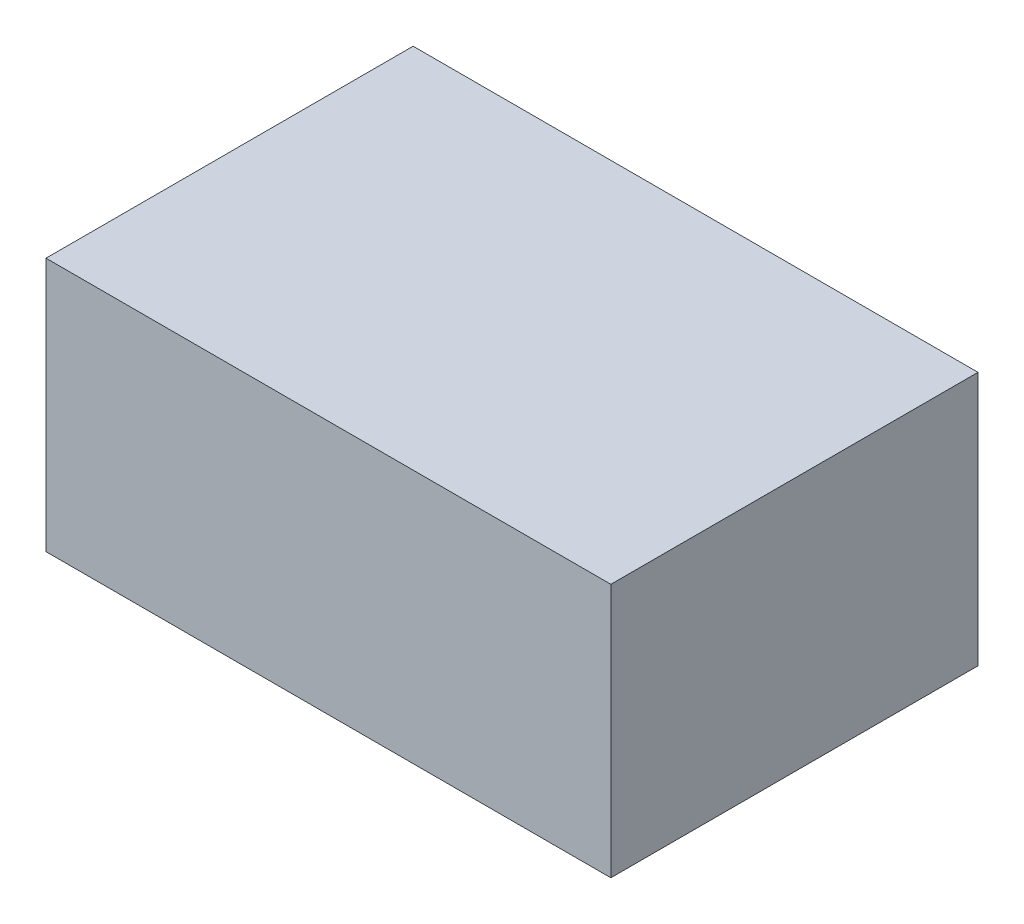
ISO-10303-21;
HEADER;
FILE_DESCRIPTION(('STEP AP214'),'2;1');
FILE_NAME('part.step','',(''),(''),'','','');
FILE_SCHEMA(('AUTOMOTIVE_DESIGN { 1 0 10303 214 1 1 1 1 }'));
ENDSEC;
DATA;
#1=APPLICATION_CONTEXT('core data for automotive mechanical design processes');
#2=APPLICATION_PROTOCOL_DEFINITION('international standard','automotive_design',2000,#1);
#3=PRODUCT_CONTEXT('',#1,'mechanical');
#4=PRODUCT('Part','Part','',(#3));
#5=PRODUCT_RELATED_PRODUCT_CATEGORY('part','',(#4));
#6=PRODUCT_DEFINITION_FORMATION('','',#4);
#7=PRODUCT_DEFINITION_CONTEXT('part definition',#1,'design');
#8=PRODUCT_DEFINITION('design','',#6,#7);
#9=PRODUCT_DEFINITION_SHAPE('','',#8);
#10=(LENGTH_UNIT() NAMED_UNIT(*) SI_UNIT(.MILLI.,.METRE.));
#11=(NAMED_UNIT(*) PLANE_ANGLE_UNIT() SI_UNIT($,.RADIAN.));
#12=(NAMED_UNIT(*) SI_UNIT($,.STERADIAN.) SOLID_ANGLE_UNIT());
#13=UNCERTAINTY_MEASURE_WITH_UNIT(LENGTH_MEASURE(1.E-05),#10,'distance_accuracy_value','');
#14=(GEOMETRIC_REPRESENTATION_CONTEXT(3) GLOBAL_UNCERTAINTY_ASSIGNED_CONTEXT((#13)) GLOBAL_UNIT_ASSIGNED_CONTEXT((#10,
#11,#12)) REPRESENTATION_CONTEXT('',''));
#15=CARTESIAN_POINT('',(0.,0.,0.));
#16=DIRECTION('',(0.,0.,1.));
#17=DIRECTION('',(1.,0.,0.));
#18=AXIS2_PLACEMENT_3D('',#15,#16,#17);
#19=CARTESIAN_POINT('',(0.,45.72,0.));
#20=DIRECTION('',(1.,0.,0.));
#21=DIRECTION('',(0.,0.,-1.));
#22=AXIS2_PLACEMENT_3D('',#19,#20,#21);
#23=PLANE('',#22);
#24=DIRECTION('',(0.,0.,1.));
#25=VECTOR('',#24,1.);
#26=CARTESIAN_POINT('',(0.,0.,0.));
#27=LINE('',#26,#25);
#28=CARTESIAN_POINT('',(0.,0.,-66.04));
#29=VERTEX_POINT('',#28);
#30=CARTESIAN_POINT('',(0.,0.,0.));
#31=VERTEX_POINT('',#30);
#32=EDGE_CURVE('E96',#29,#31,#27,.T.);
#33=ORIENTED_EDGE('',*,*,#32,.T.);
#34=DIRECTION('',(0.,-1.,0.));
#35=VECTOR('',#34,1.);
#36=CARTESIAN_POINT('',(0.,45.72,0.));
#37=LINE('',#36,#35);
#38=CARTESIAN_POINT('',(0.,45.72,0.));
#39=VERTEX_POINT('',#38);
#40=EDGE_CURVE('E11',#39,#31,#37,.T.);
#41=ORIENTED_EDGE('',*,*,#40,.F.);
#42=DIRECTION('',(0.,0.,1.));
#43=VECTOR('',#42,1.);
#44=CARTESIAN_POINT('',(0.,45.72,0.));
#45=LINE('',#44,#43);
#46=CARTESIAN_POINT('',(0.,45.72,-66.04));
#47=VERTEX_POINT('',#46);
#48=EDGE_CURVE('E84',#47,#39,#45,.T.);
#49=ORIENTED_EDGE('',*,*,#48,.F.);
#50=DIRECTION('',(0.,-1.,0.));
#51=VECTOR('',#50,1.);
#52=CARTESIAN_POINT('',(0.,45.72,-66.04));
#53=LINE('',#52,#51);
#54=EDGE_CURVE('E92',#47,#29,#53,.T.);
#55=ORIENTED_EDGE('',*,*,#54,.T.);
#56=EDGE_LOOP('',(#33,#41,#49,#55));
#57=FACE_BOUND('',#56,.T.);
#58=ADVANCED_FACE('F33',(#57),#23,.F.);
#59=CARTESIAN_POINT('',(0.,45.72,0.));
#60=DIRECTION('',(0.,0.,-1.));
#61=DIRECTION('',(-1.,0.,0.));
#62=AXIS2_PLACEMENT_3D('',#59,#60,#61);
#63=PLANE('',#62);
#64=DIRECTION('',(1.,0.,0.));
#65=VECTOR('',#64,1.);
#66=CARTESIAN_POINT('',(0.,0.,0.));
#67=LINE('',#66,#65);
#68=CARTESIAN_POINT('',(101.6,0.,0.));
#69=VERTEX_POINT('',#68);
#70=EDGE_CURVE('E88',#31,#69,#67,.T.);
#71=ORIENTED_EDGE('',*,*,#70,.T.);
#72=DIRECTION('',(0.,-1.,0.));
#73=VECTOR('',#72,1.);
#74=CARTESIAN_POINT('',(101.6,45.72,0.));
#75=LINE('',#74,#73);
#76=CARTESIAN_POINT('',(101.6,45.72,0.));
#77=VERTEX_POINT('',#76);
#78=EDGE_CURVE('E41',#77,#69,#75,.T.);
#79=ORIENTED_EDGE('',*,*,#78,.F.);
#80=DIRECTION('',(1.,0.,0.));
#81=VECTOR('',#80,1.);
#82=CARTESIAN_POINT('',(0.,45.72,0.));
#83=LINE('',#82,#81);
#84=EDGE_CURVE('E79',#39,#77,#83,.T.);
#85=ORIENTED_EDGE('',*,*,#84,.F.);
#86=ORIENTED_EDGE('',*,*,#40,.T.);
#87=EDGE_LOOP('',(#71,#79,#85,#86));
#88=FACE_BOUND('',#87,.T.);
#89=ADVANCED_FACE('F87',(#88),#63,.F.);
#90=CARTESIAN_POINT('',(101.6,45.72,0.));
#91=DIRECTION('',(-1.,0.,0.));
#92=DIRECTION('',(0.,0.,1.));
#93=AXIS2_PLACEMENT_3D('',#90,#91,#92);
#94=PLANE('',#93);
#95=DIRECTION('',(0.,0.,-1.));
#96=VECTOR('',#95,1.);
#97=CARTESIAN_POINT('',(101.6,0.,0.));
#98=LINE('',#97,#96);
#99=CARTESIAN_POINT('',(101.6,0.,-66.04));
#100=VERTEX_POINT('',#99);
#101=EDGE_CURVE('E66',#69,#100,#98,.T.);
#102=ORIENTED_EDGE('',*,*,#101,.T.);
#103=DIRECTION('',(0.,-1.,0.));
#104=VECTOR('',#103,1.);
#105=CARTESIAN_POINT('',(101.6,45.72,-66.04));
#106=LINE('',#105,#104);
#107=CARTESIAN_POINT('',(101.6,45.72,-66.04));
#108=VERTEX_POINT('',#107);
#109=EDGE_CURVE('E89',#108,#100,#106,.T.);
#110=ORIENTED_EDGE('',*,*,#109,.F.);
#111=DIRECTION('',(0.,0.,-1.));
#112=VECTOR('',#111,1.);
#113=CARTESIAN_POINT('',(101.6,45.72,0.));
#114=LINE('',#113,#112);
#115=EDGE_CURVE('E82',#77,#108,#114,.T.);
#116=ORIENTED_EDGE('',*,*,#115,.F.);
#117=ORIENTED_EDGE('',*,*,#78,.T.);
#118=EDGE_LOOP('',(#102,#110,#116,#117));
#119=FACE_BOUND('',#118,.T.);
#120=ADVANCED_FACE('F90',(#119),#94,.F.);
#121=CARTESIAN_POINT('',(0.,45.72,-66.04));
#122=DIRECTION('',(0.,0.,1.));
#123=DIRECTION('',(1.,0.,0.));
#124=AXIS2_PLACEMENT_3D('',#121,#122,#123);
#125=PLANE('',#124);
#126=DIRECTION('',(-1.,0.,0.));
#127=VECTOR('',#126,1.);
#128=CARTESIAN_POINT('',(0.,0.,-66.04));
#129=LINE('',#128,#127);
#130=EDGE_CURVE('E72',#100,#29,#129,.T.);
#131=ORIENTED_EDGE('',*,*,#130,.T.);
#132=ORIENTED_EDGE('',*,*,#54,.F.);
#133=DIRECTION('',(-1.,0.,0.));
#134=VECTOR('',#133,1.);
#135=CARTESIAN_POINT('',(0.,45.72,-66.04));
#136=LINE('',#135,#134);
#137=EDGE_CURVE('E49',#108,#47,#136,.T.);
#138=ORIENTED_EDGE('',*,*,#137,.F.);
#139=ORIENTED_EDGE('',*,*,#109,.T.);
#140=EDGE_LOOP('',(#131,#132,#138,#139));
#141=FACE_BOUND('',#140,.T.);
#142=ADVANCED_FACE('F103',(#141),#125,.F.);
#143=CARTESIAN_POINT('',(0.,45.72,0.));
#144=DIRECTION('',(0.,-1.,0.));
#145=DIRECTION('',(0.,0.,-1.));
#146=AXIS2_PLACEMENT_3D('',#143,#144,#145);
#147=PLANE('',#146);
#148=ORIENTED_EDGE('',*,*,#48,.T.);
#149=ORIENTED_EDGE('',*,*,#84,.T.);
#150=ORIENTED_EDGE('',*,*,#115,.T.);
#151=ORIENTED_EDGE('',*,*,#137,.T.);
#152=EDGE_LOOP('',(#148,#149,#150,#151));
#153=FACE_BOUND('',#152,.T.);
#154=ADVANCED_FACE('F80',(#153),#147,.F.);
#155=CARTESIAN_POINT('',(0.,0.,0.));
#156=DIRECTION('',(0.,-1.,0.));
#157=DIRECTION('',(0.,0.,-1.));
#158=AXIS2_PLACEMENT_3D('',#155,#156,#157);
#159=PLANE('',#158);
#160=ORIENTED_EDGE('',*,*,#32,.F.);
#161=ORIENTED_EDGE('',*,*,#130,.F.);
#162=ORIENTED_EDGE('',*,*,#101,.F.);
#163=ORIENTED_EDGE('',*,*,#70,.F.);
#164=EDGE_LOOP('',(#160,#161,#162,#163));
#165=FACE_BOUND('',#164,.T.);
#166=ADVANCED_FACE('F106',(#165),#159,.T.);
#167=CLOSED_SHELL('',(#58,#89,#120,#142,#154,#166));
#168=MANIFOLD_SOLID_BREP('B2',#167);
#169=ADVANCED_BREP_SHAPE_REPRESENTATION('',(#18,#168),#14);
#170=SHAPE_DEFINITION_REPRESENTATION(#9,#169);
ENDSEC;
END-ISO-10303-21;
